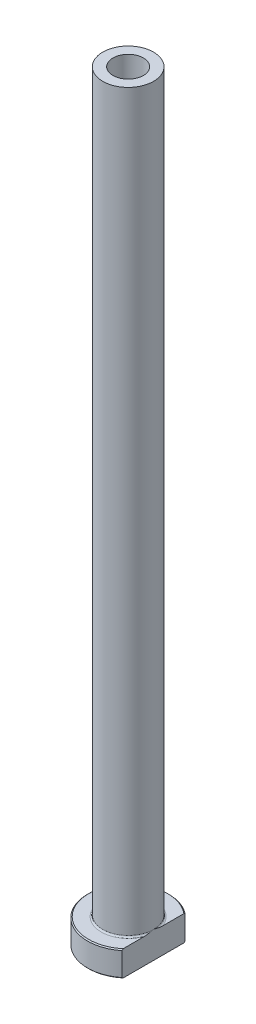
ISO-10303-21;
HEADER;
FILE_DESCRIPTION(('STEP AP214'),'2;1');
FILE_NAME('part.step','',(''),(''),'','','');
FILE_SCHEMA(('AUTOMOTIVE_DESIGN { 1 0 10303 214 1 1 1 1 }'));
ENDSEC;
DATA;
#1=APPLICATION_CONTEXT('core data for automotive mechanical design processes');
#2=APPLICATION_PROTOCOL_DEFINITION('international standard','automotive_design',2000,#1);
#3=PRODUCT_CONTEXT('',#1,'mechanical');
#4=PRODUCT('Part','Part','',(#3));
#5=PRODUCT_RELATED_PRODUCT_CATEGORY('part','',(#4));
#6=PRODUCT_DEFINITION_FORMATION('','',#4);
#7=PRODUCT_DEFINITION_CONTEXT('part definition',#1,'design');
#8=PRODUCT_DEFINITION('design','',#6,#7);
#9=PRODUCT_DEFINITION_SHAPE('','',#8);
#10=(LENGTH_UNIT() NAMED_UNIT(*) SI_UNIT(.MILLI.,.METRE.));
#11=(NAMED_UNIT(*) PLANE_ANGLE_UNIT() SI_UNIT($,.RADIAN.));
#12=(NAMED_UNIT(*) SI_UNIT($,.STERADIAN.) SOLID_ANGLE_UNIT());
#13=UNCERTAINTY_MEASURE_WITH_UNIT(LENGTH_MEASURE(1.E-05),#10,'distance_accuracy_value','');
#14=(GEOMETRIC_REPRESENTATION_CONTEXT(3) GLOBAL_UNCERTAINTY_ASSIGNED_CONTEXT((#13)) GLOBAL_UNIT_ASSIGNED_CONTEXT((#10,
#11,#12)) REPRESENTATION_CONTEXT('',''));
#15=CARTESIAN_POINT('',(0.,0.,0.));
#16=DIRECTION('',(0.,0.,1.));
#17=DIRECTION('',(1.,0.,0.));
#18=AXIS2_PLACEMENT_3D('',#15,#16,#17);
#19=CARTESIAN_POINT('',(0.,92.1876809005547,0.));
#20=DIRECTION('',(0.,1.,0.));
#21=DIRECTION('',(0.,0.,1.));
#22=AXIS2_PLACEMENT_3D('',#19,#20,#21);
#23=CYLINDRICAL_SURFACE('',#22,3.);
#24=CARTESIAN_POINT('',(0.,150.,0.));
#25=DIRECTION('',(0.,1.,0.));
#26=DIRECTION('',(0.,0.,1.));
#27=AXIS2_PLACEMENT_3D('',#24,#25,#26);
#28=CIRCLE('',#27,3.);
#29=CARTESIAN_POINT('',(0.,150.,3.));
#30=VERTEX_POINT('',#29);
#31=EDGE_CURVE('E167',#30,#30,#28,.T.);
#32=ORIENTED_EDGE('',*,*,#31,.T.);
#33=EDGE_LOOP('',(#32));
#34=FACE_BOUND('',#33,.T.);
#35=CARTESIAN_POINT('',(0.,105.,0.));
#36=DIRECTION('',(0.,1.,0.));
#37=DIRECTION('',(0.,0.,1.));
#38=AXIS2_PLACEMENT_3D('',#35,#36,#37);
#39=CIRCLE('',#38,3.);
#40=CARTESIAN_POINT('',(0.,105.,3.));
#41=VERTEX_POINT('',#40);
#42=EDGE_CURVE('E170',#41,#41,#39,.T.);
#43=ORIENTED_EDGE('',*,*,#42,.F.);
#44=EDGE_LOOP('',(#43));
#45=FACE_BOUND('',#44,.T.);
#46=ADVANCED_FACE('F32',(#34,#45),#23,.F.);
#47=CARTESIAN_POINT('',(-3.,150.,0.));
#48=DIRECTION('',(0.,1.,0.));
#49=DIRECTION('',(0.,0.,1.));
#50=AXIS2_PLACEMENT_3D('',#47,#48,#49);
#51=PLANE('',#50);
#52=CARTESIAN_POINT('',(0.,150.,0.));
#53=DIRECTION('',(0.,1.,0.));
#54=DIRECTION('',(0.,0.,1.));
#55=AXIS2_PLACEMENT_3D('',#52,#53,#54);
#56=CIRCLE('',#55,5.00000000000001);
#57=CARTESIAN_POINT('',(0.,150.,5.00000000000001));
#58=VERTEX_POINT('',#57);
#59=EDGE_CURVE('E174',#58,#58,#56,.T.);
#60=ORIENTED_EDGE('',*,*,#59,.T.);
#61=EDGE_LOOP('',(#60));
#62=FACE_BOUND('',#61,.T.);
#63=ORIENTED_EDGE('',*,*,#31,.F.);
#64=EDGE_LOOP('',(#63));
#65=FACE_BOUND('',#64,.T.);
#66=ADVANCED_FACE('F157',(#62,#65),#51,.T.);
#67=CARTESIAN_POINT('',(0.,92.1876809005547,0.));
#68=DIRECTION('',(0.,1.,0.));
#69=DIRECTION('',(0.,0.,1.));
#70=AXIS2_PLACEMENT_3D('',#67,#68,#69);
#71=CYLINDRICAL_SURFACE('',#70,5.);
#72=CARTESIAN_POINT('',(0.,5.3,0.));
#73=DIRECTION('',(0.,1.,0.));
#74=DIRECTION('',(0.,0.,1.));
#75=AXIS2_PLACEMENT_3D('',#72,#73,#74);
#76=CIRCLE('',#75,5.);
#77=CARTESIAN_POINT('',(5.,5.3,0.));
#78=VERTEX_POINT('',#77);
#79=EDGE_CURVE('E180',#78,#78,#76,.T.);
#80=ORIENTED_EDGE('',*,*,#79,.T.);
#81=EDGE_LOOP('',(#80));
#82=FACE_BOUND('',#81,.T.);
#83=ORIENTED_EDGE('',*,*,#59,.F.);
#84=EDGE_LOOP('',(#83));
#85=FACE_BOUND('',#84,.T.);
#86=ADVANCED_FACE('F162',(#82,#85),#71,.T.);
#87=CARTESIAN_POINT('',(-4.99999999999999,5.,0.));
#88=DIRECTION('',(0.,1.,0.));
#89=DIRECTION('',(0.,0.,1.));
#90=AXIS2_PLACEMENT_3D('',#87,#88,#89);
#91=PLANE('',#90);
#92=DIRECTION('',(0.,0.,1.));
#93=VECTOR('',#92,1.);
#94=CARTESIAN_POINT('',(5.,5.,0.));
#95=LINE('',#94,#93);
#96=CARTESIAN_POINT('',(5.,5.,-5.98665181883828));
#97=VERTEX_POINT('',#96);
#98=CARTESIAN_POINT('',(5.,5.,-1.7578395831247));
#99=VERTEX_POINT('',#98);
#100=EDGE_CURVE('E54',#97,#99,#95,.T.);
#101=ORIENTED_EDGE('',*,*,#100,.F.);
#102=CARTESIAN_POINT('',(0.,5.,0.));
#103=DIRECTION('',(0.,1.,0.));
#104=DIRECTION('',(0.,0.,1.));
#105=AXIS2_PLACEMENT_3D('',#102,#103,#104);
#106=CIRCLE('',#105,7.79999999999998);
#107=CARTESIAN_POINT('',(4.99999999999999,5.,5.98665181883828));
#108=VERTEX_POINT('',#107);
#109=EDGE_CURVE('E186',#97,#108,#106,.T.);
#110=ORIENTED_EDGE('',*,*,#109,.T.);
#111=CARTESIAN_POINT('',(5.,5.,1.7578395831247));
#112=VERTEX_POINT('',#111);
#113=EDGE_CURVE('E134',#112,#108,#95,.T.);
#114=ORIENTED_EDGE('',*,*,#113,.F.);
#115=CARTESIAN_POINT('',(0.,5.,0.));
#116=DIRECTION('',(0.,1.,0.));
#117=DIRECTION('',(0.,0.,1.));
#118=AXIS2_PLACEMENT_3D('',#115,#116,#117);
#119=CIRCLE('',#118,5.3);
#120=EDGE_CURVE('E183',#112,#99,#119,.F.);
#121=ORIENTED_EDGE('',*,*,#120,.T.);
#122=EDGE_LOOP('',(#101,#110,#114,#121));
#123=FACE_BOUND('',#122,.T.);
#124=ADVANCED_FACE('F197',(#123),#91,.T.);
#125=CARTESIAN_POINT('',(0.,92.1876809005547,0.));
#126=DIRECTION('',(0.,1.,0.));
#127=DIRECTION('',(0.,0.,1.));
#128=AXIS2_PLACEMENT_3D('',#125,#126,#127);
#129=CYLINDRICAL_SURFACE('',#128,7.99999999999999);
#130=DIRECTION('',(0.,-1.,0.));
#131=VECTOR('',#130,1.);
#132=CARTESIAN_POINT('',(4.99999999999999,150.,6.24499799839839));
#133=LINE('',#132,#131);
#134=CARTESIAN_POINT('',(4.99999999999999,4.79999999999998,6.24499799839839));
#135=VERTEX_POINT('',#134);
#136=CARTESIAN_POINT('',(4.99999999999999,0.200000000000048,6.24499799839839));
#137=VERTEX_POINT('',#136);
#138=EDGE_CURVE('E82',#135,#137,#133,.T.);
#139=ORIENTED_EDGE('',*,*,#138,.F.);
#140=CARTESIAN_POINT('',(0.,4.79999999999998,0.));
#141=DIRECTION('',(0.,1.,0.));
#142=DIRECTION('',(0.,0.,1.));
#143=AXIS2_PLACEMENT_3D('',#140,#141,#142);
#144=CIRCLE('',#143,7.99999999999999);
#145=CARTESIAN_POINT('',(5.,4.79999999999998,-6.24499799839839));
#146=VERTEX_POINT('',#145);
#147=EDGE_CURVE('E95',#135,#146,#144,.F.);
#148=ORIENTED_EDGE('',*,*,#147,.T.);
#149=DIRECTION('',(0.,-1.,0.));
#150=VECTOR('',#149,1.);
#151=CARTESIAN_POINT('',(5.,150.,-6.24499799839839));
#152=LINE('',#151,#150);
#153=CARTESIAN_POINT('',(5.,0.200000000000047,-6.24499799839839));
#154=VERTEX_POINT('',#153);
#155=EDGE_CURVE('E192',#146,#154,#152,.T.);
#156=ORIENTED_EDGE('',*,*,#155,.T.);
#157=CARTESIAN_POINT('',(0.,0.200000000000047,0.));
#158=DIRECTION('',(0.,-1.,0.));
#159=DIRECTION('',(0.,0.,-1.));
#160=AXIS2_PLACEMENT_3D('',#157,#158,#159);
#161=CIRCLE('',#160,7.99999999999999);
#162=EDGE_CURVE('E98',#154,#137,#161,.F.);
#163=ORIENTED_EDGE('',*,*,#162,.T.);
#164=EDGE_LOOP('',(#139,#148,#156,#163));
#165=FACE_BOUND('',#164,.T.);
#166=ADVANCED_FACE('F190',(#165),#129,.T.);
#167=CARTESIAN_POINT('',(-7.99999999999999,0.,0.));
#168=DIRECTION('',(0.,-1.,0.));
#169=DIRECTION('',(0.,0.,-1.));
#170=AXIS2_PLACEMENT_3D('',#167,#168,#169);
#171=PLANE('',#170);
#172=CARTESIAN_POINT('',(0.,0.,0.));
#173=DIRECTION('',(0.,-1.,0.));
#174=DIRECTION('',(0.,0.,-1.));
#175=AXIS2_PLACEMENT_3D('',#172,#173,#174);
#176=CIRCLE('',#175,3.74999999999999);
#177=CARTESIAN_POINT('',(0.,0.,-3.74999999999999));
#178=VERTEX_POINT('',#177);
#179=EDGE_CURVE('E40',#178,#178,#176,.F.);
#180=ORIENTED_EDGE('',*,*,#179,.T.);
#181=EDGE_LOOP('',(#180));
#182=FACE_BOUND('',#181,.T.);
#183=DIRECTION('',(0.,0.,-1.));
#184=VECTOR('',#183,1.);
#185=CARTESIAN_POINT('',(4.99999999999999,0.,6.24499799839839));
#186=LINE('',#185,#184);
#187=CARTESIAN_POINT('',(4.99999999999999,0.,5.98665181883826));
#188=VERTEX_POINT('',#187);
#189=CARTESIAN_POINT('',(5.,0.,-5.98665181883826));
#190=VERTEX_POINT('',#189);
#191=EDGE_CURVE('E47',#188,#190,#186,.T.);
#192=ORIENTED_EDGE('',*,*,#191,.F.);
#193=CARTESIAN_POINT('',(0.,0.,0.));
#194=DIRECTION('',(0.,-1.,0.));
#195=DIRECTION('',(0.,0.,-1.));
#196=AXIS2_PLACEMENT_3D('',#193,#194,#195);
#197=CIRCLE('',#196,7.79999999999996);
#198=EDGE_CURVE('E92',#188,#190,#197,.T.);
#199=ORIENTED_EDGE('',*,*,#198,.T.);
#200=EDGE_LOOP('',(#192,#199));
#201=FACE_BOUND('',#200,.T.);
#202=ADVANCED_FACE('F91',(#182,#201),#171,.T.);
#203=CARTESIAN_POINT('',(0.,92.1876809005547,0.));
#204=DIRECTION('',(0.,1.,0.));
#205=DIRECTION('',(0.,0.,1.));
#206=AXIS2_PLACEMENT_3D('',#203,#204,#205);
#207=CYLINDRICAL_SURFACE('',#206,3.25);
#208=CARTESIAN_POINT('',(0.,0.5,0.));
#209=DIRECTION('',(0.,-1.,0.));
#210=DIRECTION('',(0.,0.,-1.));
#211=AXIS2_PLACEMENT_3D('',#208,#209,#210);
#212=CIRCLE('',#211,3.25);
#213=CARTESIAN_POINT('',(0.,0.5,-3.25));
#214=VERTEX_POINT('',#213);
#215=EDGE_CURVE('E11',#214,#214,#212,.T.);
#216=ORIENTED_EDGE('',*,*,#215,.T.);
#217=EDGE_LOOP('',(#216));
#218=FACE_BOUND('',#217,.T.);
#219=CARTESIAN_POINT('',(0.,93.,0.));
#220=DIRECTION('',(0.,1.,0.));
#221=DIRECTION('',(0.,0.,1.));
#222=AXIS2_PLACEMENT_3D('',#219,#220,#221);
#223=CIRCLE('',#222,3.25);
#224=CARTESIAN_POINT('',(0.,93.,3.25));
#225=VERTEX_POINT('',#224);
#226=EDGE_CURVE('E172',#225,#225,#223,.T.);
#227=ORIENTED_EDGE('',*,*,#226,.T.);
#228=EDGE_LOOP('',(#227));
#229=FACE_BOUND('',#228,.T.);
#230=ADVANCED_FACE('F215',(#218,#229),#207,.F.);
#231=CARTESIAN_POINT('',(0.,93.,0.));
#232=DIRECTION('',(0.,-1.,0.));
#233=DIRECTION('',(0.,0.,-1.));
#234=AXIS2_PLACEMENT_3D('',#231,#232,#233);
#235=CONICAL_SURFACE('',#234,3.25,0.0208303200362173);
#236=ORIENTED_EDGE('',*,*,#42,.T.);
#237=EDGE_LOOP('',(#236));
#238=FACE_BOUND('',#237,.T.);
#239=ORIENTED_EDGE('',*,*,#226,.F.);
#240=EDGE_LOOP('',(#239));
#241=FACE_BOUND('',#240,.T.);
#242=ADVANCED_FACE('F111',(#238,#241),#235,.F.);
#243=CARTESIAN_POINT('',(0.,5.3,0.));
#244=DIRECTION('',(0.,1.,0.));
#245=DIRECTION('',(0.,0.,1.));
#246=AXIS2_PLACEMENT_3D('',#243,#244,#245);
#247=TOROIDAL_SURFACE('',#246,5.3,0.3);
#248=ORIENTED_EDGE('',*,*,#120,.F.);
#249=CARTESIAN_POINT('',(5.,5.3,0.));
#250=CARTESIAN_POINT('',(5.,5.30000062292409,-1.31469405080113E-10));
#251=CARTESIAN_POINT('',(5.,5.30000124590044,2.52759284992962E-07));
#252=CARTESIAN_POINT('',(5.,5.30000240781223,9.47164481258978E-07));
#253=CARTESIAN_POINT('',(5.,5.30000293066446,1.40594053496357E-06));
#254=CARTESIAN_POINT('',(5.,5.30000402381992,2.50637628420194E-06));
#255=CARTESIAN_POINT('',(5.,5.30000457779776,3.16588935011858E-06));
#256=CARTESIAN_POINT('',(5.,5.30000556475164,4.5285999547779E-06));
#257=CARTESIAN_POINT('',(5.,5.30000600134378,5.22939475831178E-06));
#258=CARTESIAN_POINT('',(5.,5.30000763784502,7.96122031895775E-06));
#259=CARTESIAN_POINT('',(5.,5.30000875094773,1.00477415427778E-05));
#260=CARTESIAN_POINT('',(5.,5.30001056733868,1.41660880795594E-05));
#261=CARTESIAN_POINT('',(5.,5.30001129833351,1.6186178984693E-05));
#262=CARTESIAN_POINT('',(5.,5.3000143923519,2.47865751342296E-05));
#263=CARTESIAN_POINT('',(5.,5.30001672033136,3.13830297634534E-05));
#264=CARTESIAN_POINT('',(5.,5.30002012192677,4.38084236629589E-05));
#265=CARTESIAN_POINT('',(5.,5.30002133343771,4.95992753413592E-05));
#266=CARTESIAN_POINT('',(5.,5.30003020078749,9.27862636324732E-05));
#267=CARTESIAN_POINT('',(5.,5.30003696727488,0.000130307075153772));
#268=CARTESIAN_POINT('',(4.99999999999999,5.30006659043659,0.000278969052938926));
#269=CARTESIAN_POINT('',(4.99999999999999,5.30009481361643,0.000389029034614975));
#270=CARTESIAN_POINT('',(5.,5.30020506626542,0.000826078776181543));
#271=CARTESIAN_POINT('',(5.,5.30028365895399,0.00115365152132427));
#272=CARTESIAN_POINT('',(4.99999999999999,5.30059919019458,0.0024592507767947));
#273=CARTESIAN_POINT('',(4.99999999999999,5.30084048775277,0.00343651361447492));
#274=CARTESIAN_POINT('',(5.,5.30184626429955,0.00752058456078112));
#275=CARTESIAN_POINT('',(5.,5.30260525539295,0.0106283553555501));
#276=CARTESIAN_POINT('',(4.99999999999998,5.30996461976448,0.0407482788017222));
#277=CARTESIAN_POINT('',(4.99999999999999,5.31658985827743,0.0677561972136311));
#278=CARTESIAN_POINT('',(5.,5.32953319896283,0.120688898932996));
#279=CARTESIAN_POINT('',(5.,5.33585289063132,0.146613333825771));
#280=CARTESIAN_POINT('',(4.99999999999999,5.34926050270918,0.201795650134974));
#281=CARTESIAN_POINT('',(5.,5.35634306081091,0.231054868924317));
#282=CARTESIAN_POINT('',(5.,5.37050252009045,0.289917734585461));
#283=CARTESIAN_POINT('',(5.,5.37757848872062,0.319521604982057));
#284=CARTESIAN_POINT('',(5.,5.39452602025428,0.391032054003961));
#285=CARTESIAN_POINT('',(5.,5.40434071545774,0.432952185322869));
#286=CARTESIAN_POINT('',(5.,5.42340141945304,0.515763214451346));
#287=CARTESIAN_POINT('',(5.,5.43265559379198,0.556652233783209));
#288=CARTESIAN_POINT('',(5.,5.45710553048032,0.667075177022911));
#289=CARTESIAN_POINT('',(5.,5.47194176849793,0.736689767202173));
#290=CARTESIAN_POINT('',(5.,5.50018229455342,0.876836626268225));
#291=CARTESIAN_POINT('',(5.,5.51357312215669,0.947371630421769));
#292=CARTESIAN_POINT('',(5.,5.53930921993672,1.09497328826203));
#293=CARTESIAN_POINT('',(5.,5.55146217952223,1.17207432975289));
#294=CARTESIAN_POINT('',(5.,5.57239669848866,1.32672649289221));
#295=CARTESIAN_POINT('',(5.,5.58117877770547,1.40427754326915));
#296=CARTESIAN_POINT('',(5.,5.59499725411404,1.56873827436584));
#297=CARTESIAN_POINT('',(5.,5.59948802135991,1.65570044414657));
#298=CARTESIAN_POINT('',(5.,5.60018885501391,1.785353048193));
#299=CARTESIAN_POINT('',(5.,5.5994521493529,1.82802575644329));
#300=CARTESIAN_POINT('',(5.,5.59559364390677,1.91325081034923));
#301=CARTESIAN_POINT('',(5.,5.59247319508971,1.95580321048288));
#302=CARTESIAN_POINT('',(5.,5.5838324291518,2.03512365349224));
#303=CARTESIAN_POINT('',(5.,5.57867386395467,2.07192937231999));
#304=CARTESIAN_POINT('',(5.,5.56543793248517,2.14526756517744));
#305=CARTESIAN_POINT('',(5.,5.55734203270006,2.18179676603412));
#306=CARTESIAN_POINT('',(5.,5.53718005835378,2.25427226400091));
#307=CARTESIAN_POINT('',(5.,5.52507057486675,2.29020746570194));
#308=CARTESIAN_POINT('',(5.,5.50270928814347,2.34223029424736));
#309=CARTESIAN_POINT('',(5.,5.49457811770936,2.35922314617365));
#310=CARTESIAN_POINT('',(5.,5.47657809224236,2.39224900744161));
#311=CARTESIAN_POINT('',(5.,5.46671281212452,2.40828390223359));
#312=CARTESIAN_POINT('',(5.,5.44695893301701,2.43579467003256));
#313=CARTESIAN_POINT('',(5.,5.43745879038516,2.44754592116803));
#314=CARTESIAN_POINT('',(5.,5.4167791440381,2.46946476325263));
#315=CARTESIAN_POINT('',(5.,5.4056054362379,2.47963758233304));
#316=CARTESIAN_POINT('',(5.,5.38617750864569,2.49393642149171));
#317=CARTESIAN_POINT('',(5.,5.3785164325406,2.49886271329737));
#318=CARTESIAN_POINT('',(5.,5.362527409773,2.50749953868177));
#319=CARTESIAN_POINT('',(5.,5.35419984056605,2.51121075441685));
#320=CARTESIAN_POINT('',(5.,5.33690648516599,2.51712941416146));
#321=CARTESIAN_POINT('',(5.,5.32793451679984,2.5193192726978));
#322=CARTESIAN_POINT('',(5.,5.30973576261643,2.52185978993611));
#323=CARTESIAN_POINT('',(5.,5.30050931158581,2.52221275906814));
#324=CARTESIAN_POINT('',(5.,5.28349166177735,2.52112455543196));
#325=CARTESIAN_POINT('',(5.,5.27568322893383,2.51993178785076));
#326=CARTESIAN_POINT('',(5.,5.26036860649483,2.51628294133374));
#327=CARTESIAN_POINT('',(5.,5.25286261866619,2.51382603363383));
#328=CARTESIAN_POINT('',(5.,5.2359026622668,2.50685484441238));
#329=CARTESIAN_POINT('',(5.,5.22661875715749,2.50192984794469));
#330=CARTESIAN_POINT('',(5.,5.20895514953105,2.49066548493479));
#331=CARTESIAN_POINT('',(5.,5.20057756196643,2.48432291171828));
#332=CARTESIAN_POINT('',(5.,5.1798700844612,2.46645212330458));
#333=CARTESIAN_POINT('',(5.,5.16824151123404,2.45411867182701));
#334=CARTESIAN_POINT('',(5.,5.14692461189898,2.42790849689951));
#335=CARTESIAN_POINT('',(5.,5.13723987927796,2.41402898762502));
#336=CARTESIAN_POINT('',(5.,5.11080706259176,2.37143175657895));
#337=CARTESIAN_POINT('',(5.,5.09628770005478,2.34134703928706));
#338=CARTESIAN_POINT('',(5.,5.07130349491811,2.27940731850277));
#339=CARTESIAN_POINT('',(5.,5.06087110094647,2.24754035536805));
#340=CARTESIAN_POINT('',(5.,5.03890359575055,2.16787245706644));
#341=CARTESIAN_POINT('',(5.,5.02913523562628,2.1195906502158));
#342=CARTESIAN_POINT('',(5.,5.01416953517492,2.02224928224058));
#343=CARTESIAN_POINT('',(5.,5.00898637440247,1.97318778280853));
#344=CARTESIAN_POINT('',(5.,5.00220823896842,1.87635767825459));
#345=CARTESIAN_POINT('',(5.,5.00050709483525,1.82859609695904));
#346=CARTESIAN_POINT('',(5.,4.999691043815,1.73330165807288));
#347=CARTESIAN_POINT('',(5.,5.00056327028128,1.68576884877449));
#348=CARTESIAN_POINT('',(5.,5.00484296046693,1.57937770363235));
#349=CARTESIAN_POINT('',(5.,5.00880932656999,1.52054285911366));
#350=CARTESIAN_POINT('',(5.,5.01925964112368,1.40312974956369));
#351=CARTESIAN_POINT('',(5.,5.02574264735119,1.34455139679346));
#352=CARTESIAN_POINT('',(5.,5.04090087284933,1.22627662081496));
#353=CARTESIAN_POINT('',(5.,5.04962425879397,1.16658647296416));
#354=CARTESIAN_POINT('',(5.,5.06877923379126,1.04732463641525));
#355=CARTESIAN_POINT('',(5.,5.07921523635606,0.987753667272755));
#356=CARTESIAN_POINT('',(5.,5.10551698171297,0.846936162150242));
#357=CARTESIAN_POINT('',(5.,5.12196565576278,0.765799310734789));
#358=CARTESIAN_POINT('',(5.,5.15639716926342,0.604819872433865));
#359=CARTESIAN_POINT('',(5.,5.17436050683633,0.524973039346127));
#360=CARTESIAN_POINT('',(4.99999999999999,5.2092166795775,0.374726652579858));
#361=CARTESIAN_POINT('',(4.99999999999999,5.22599388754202,0.304300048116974));
#362=CARTESIAN_POINT('',(5.,5.25191105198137,0.196907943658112));
#363=CARTESIAN_POINT('',(5.,5.26090146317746,0.159905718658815));
#364=CARTESIAN_POINT('',(4.99999999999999,5.27881854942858,0.0865164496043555));
#365=CARTESIAN_POINT('',(4.99999999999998,5.28774391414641,0.0501291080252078));
#366=CARTESIAN_POINT('',(5.,5.2973962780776,0.0106218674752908));
#367=CARTESIAN_POINT('',(5.,5.29815688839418,0.00750762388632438));
#368=CARTESIAN_POINT('',(4.99999999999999,5.29916304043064,0.00342209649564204));
#369=CARTESIAN_POINT('',(4.99999999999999,5.29940309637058,0.00244985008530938));
#370=CARTESIAN_POINT('',(5.,5.29971711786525,0.00115049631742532));
#371=CARTESIAN_POINT('',(5.,5.29979541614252,0.000824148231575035));
#372=CARTESIAN_POINT('',(4.99999999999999,5.29990531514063,0.000388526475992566));
#373=CARTESIAN_POINT('',(4.99999999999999,5.299933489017,0.000278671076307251));
#374=CARTESIAN_POINT('',(5.,5.29996306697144,0.000130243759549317));
#375=CARTESIAN_POINT('',(5.,5.29996982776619,9.27511401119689E-05));
#376=CARTESIAN_POINT('',(5.,5.29997868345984,4.95929903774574E-05));
#377=CARTESIAN_POINT('',(5.,5.29997989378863,4.38036571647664E-05));
#378=CARTESIAN_POINT('',(5.,5.29998329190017,3.13814199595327E-05));
#379=CARTESIAN_POINT('',(5.,5.29998561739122,2.47865230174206E-05));
#380=CARTESIAN_POINT('',(5.,5.29998870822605,1.61877553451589E-05));
#381=CARTESIAN_POINT('',(5.,5.29998943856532,1.41677775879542E-05));
#382=CARTESIAN_POINT('',(5.,5.29999125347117,1.00495537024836E-05));
#383=CARTESIAN_POINT('',(5.,5.29999236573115,7.96302707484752E-06));
#384=CARTESIAN_POINT('',(5.,5.29999400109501,5.23107447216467E-06));
#385=CARTESIAN_POINT('',(5.,5.29999443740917,4.53021065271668E-06));
#386=CARTESIAN_POINT('',(5.,5.29999542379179,3.16731183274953E-06));
#387=CARTESIAN_POINT('',(5.,5.29999597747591,2.50767750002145E-06));
#388=CARTESIAN_POINT('',(5.,5.29999707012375,1.40695895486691E-06));
#389=CARTESIAN_POINT('',(5.,5.29999759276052,9.48032589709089E-07));
#390=CARTESIAN_POINT('',(5.,5.29999875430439,2.53244394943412E-07));
#391=CARTESIAN_POINT('',(5.,5.29999937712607,1.31460206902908E-10));
#392=CARTESIAN_POINT('',(5.,5.3,0.));
#393=B_SPLINE_CURVE_WITH_KNOTS('',3,(#249,#250,#251,#252,#253,#254,#255,#256,#257,#258,#259,
#260,#261,#262,#263,#264,#265,#266,#267,#268,#269,#270,#271,#272,#273,#274,#275,#276,#277,#278,
#279,#280,#281,#282,#283,#284,#285,#286,#287,#288,#289,#290,#291,#292,#293,#294,#295,#296,#297,
#298,#299,#300,#301,#302,#303,#304,#305,#306,#307,#308,#309,#310,#311,#312,#313,#314,#315,#316,
#317,#318,#319,#320,#321,#322,#323,#324,#325,#326,#327,#328,#329,#330,#331,#332,#333,#334,#335,
#336,#337,#338,#339,#340,#341,#342,#343,#344,#345,#346,#347,#348,#349,#350,#351,#352,#353,#354,
#355,#356,#357,#358,#359,#360,#361,#362,#363,#364,#365,#366,#367,#368,#369,#370,#371,#372,#373,
#374,#375,#376,#377,#378,#379,#380,#381,#382,#383,#384,#385,#386,#387,#388,#389,#390,#391,#392),
.UNSPECIFIED.,.T.,.F.,(4,2,2,2,2,2,2,2,2,2,2,2,2,2,2,2,2,2,2,2,2,2,2,2,2,2,2,2,2,2,2,2,2,2,2,2,
2,2,2,2,2,2,2,2,2,2,2,2,2,2,2,2,2,2,2,2,2,2,2,2,2,2,2,2,2,2,2,2,2,2,2,4),(0.,
1.88939227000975E-06,3.98058756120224E-06,6.54818360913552E-06,9.02404134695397E-06,
1.60938721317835E-05,2.25328161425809E-05,4.34843886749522E-05,6.12120154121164E-05,
0.00017562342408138,0.000516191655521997,0.00152710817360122,0.0045465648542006,
0.0141443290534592,0.0975679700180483,0.177619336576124,0.267931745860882,0.359245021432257,
0.488405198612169,0.614173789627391,0.827694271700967,1.04305715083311,1.27715608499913,
1.51121890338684,1.77214751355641,1.90013509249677,2.02805018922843,2.13945459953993,
2.25157451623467,2.36494894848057,2.42139235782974,2.4777207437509,2.52293802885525,
2.56800219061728,2.59524342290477,2.62246933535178,2.65000494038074,2.67750590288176,
2.70108948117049,2.72468854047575,2.75603978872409,2.78746268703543,2.83802806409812,
2.88868607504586,2.98834295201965,3.08877575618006,3.23618650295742,3.38405153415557,
3.52733651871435,3.66990630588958,3.84673903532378,4.02350562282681,4.20444776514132,
4.38586374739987,4.63419556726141,4.87971270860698,5.09690175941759,5.21113882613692,
5.32353360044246,5.33315137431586,5.33615533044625,5.33716246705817,5.33750240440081,
5.33761672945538,5.33763445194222,5.33765539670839,5.3376618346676,5.33766890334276,
5.33767137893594,5.33767394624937,5.33767603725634,5.33767792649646),.UNSPECIFIED.);
#394=EDGE_CURVE('E126',#112,#78,#393,.T.);
#395=ORIENTED_EDGE('',*,*,#394,.T.);
#396=ORIENTED_EDGE('',*,*,#79,.F.);
#397=CARTESIAN_POINT('',(5.,5.3,0.));
#398=CARTESIAN_POINT('',(5.,5.29999937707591,1.3147082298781E-10));
#399=CARTESIAN_POINT('',(5.,5.29999875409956,-2.5275928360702E-07));
#400=CARTESIAN_POINT('',(5.,5.29999759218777,-9.47164479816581E-07));
#401=CARTESIAN_POINT('',(5.,5.29999706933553,-1.40594053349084E-06));
#402=CARTESIAN_POINT('',(5.,5.29999597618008,-2.50637628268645E-06));
#403=CARTESIAN_POINT('',(5.,5.29999542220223,-3.16588934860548E-06));
#404=CARTESIAN_POINT('',(5.,5.29999443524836,-4.52859995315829E-06));
#405=CARTESIAN_POINT('',(5.,5.29999399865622,-5.22939475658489E-06));
#406=CARTESIAN_POINT('',(5.,5.29999236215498,-7.96122031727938E-06));
#407=CARTESIAN_POINT('',(5.,5.29999124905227,-1.00477415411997E-05));
#408=CARTESIAN_POINT('',(5.,5.29998943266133,-1.41660880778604E-05));
#409=CARTESIAN_POINT('',(5.,5.2999887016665,-1.61861789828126E-05));
#410=CARTESIAN_POINT('',(5.,5.2999856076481,-2.47865751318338E-05));
#411=CARTESIAN_POINT('',(5.,5.29998327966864,-3.13830297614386E-05));
#412=CARTESIAN_POINT('',(5.,5.29997987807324,-4.38084236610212E-05));
#413=CARTESIAN_POINT('',(5.,5.2999786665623,-4.95992753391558E-05));
#414=CARTESIAN_POINT('',(5.,5.29996979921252,-9.27862636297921E-05));
#415=CARTESIAN_POINT('',(5.,5.29996303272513,-0.000130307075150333));
#416=CARTESIAN_POINT('',(4.99999999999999,5.29993340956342,-0.000278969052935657));
#417=CARTESIAN_POINT('',(4.99999999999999,5.29990518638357,-0.000389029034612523));
#418=CARTESIAN_POINT('',(5.,5.29979493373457,-0.000826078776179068));
#419=CARTESIAN_POINT('',(5.,5.29971634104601,-0.00115365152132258));
#420=CARTESIAN_POINT('',(4.99999999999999,5.29940080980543,-0.00245925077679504));
#421=CARTESIAN_POINT('',(4.99999999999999,5.29915951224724,-0.0034365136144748));
#422=CARTESIAN_POINT('',(5.,5.29815373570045,-0.00752058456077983));
#423=CARTESIAN_POINT('',(5.,5.29739474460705,-0.0106283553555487));
#424=CARTESIAN_POINT('',(4.99999999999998,5.2900353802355,-0.0407482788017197));
#425=CARTESIAN_POINT('',(4.99999999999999,5.28341014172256,-0.0677561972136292));
#426=CARTESIAN_POINT('',(5.,5.27046680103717,-0.120688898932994));
#427=CARTESIAN_POINT('',(5.,5.26414710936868,-0.146613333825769));
#428=CARTESIAN_POINT('',(4.99999999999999,5.25073949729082,-0.201795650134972));
#429=CARTESIAN_POINT('',(5.,5.24365693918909,-0.231054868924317));
#430=CARTESIAN_POINT('',(5.,5.22949747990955,-0.289917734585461));
#431=CARTESIAN_POINT('',(5.,5.22242151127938,-0.319521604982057));
#432=CARTESIAN_POINT('',(5.,5.20547397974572,-0.391032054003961));
#433=CARTESIAN_POINT('',(5.,5.19565928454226,-0.432952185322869));
#434=CARTESIAN_POINT('',(5.,5.17659858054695,-0.515763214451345));
#435=CARTESIAN_POINT('',(5.,5.16734440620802,-0.556652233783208));
#436=CARTESIAN_POINT('',(5.,5.14289446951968,-0.667075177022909));
#437=CARTESIAN_POINT('',(5.,5.12805823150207,-0.736689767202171));
#438=CARTESIAN_POINT('',(5.,5.09981770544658,-0.876836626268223));
#439=CARTESIAN_POINT('',(5.,5.0864268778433,-0.947371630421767));
#440=CARTESIAN_POINT('',(5.,5.06069078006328,-1.09497328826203));
#441=CARTESIAN_POINT('',(5.,5.04853782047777,-1.17207432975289));
#442=CARTESIAN_POINT('',(5.,5.02760330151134,-1.3267264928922));
#443=CARTESIAN_POINT('',(5.,5.01882122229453,-1.40427754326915));
#444=CARTESIAN_POINT('',(5.,5.00500274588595,-1.56873827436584));
#445=CARTESIAN_POINT('',(5.,5.00051197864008,-1.65570044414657));
#446=CARTESIAN_POINT('',(5.,4.99981114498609,-1.785353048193));
#447=CARTESIAN_POINT('',(5.,5.0005478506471,-1.82802575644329));
#448=CARTESIAN_POINT('',(5.,5.00440635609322,-1.91325081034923));
#449=CARTESIAN_POINT('',(5.,5.00752680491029,-1.95580321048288));
#450=CARTESIAN_POINT('',(5.,5.0161675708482,-2.03512365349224));
#451=CARTESIAN_POINT('',(5.,5.02132613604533,-2.07192937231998));
#452=CARTESIAN_POINT('',(5.,5.03456206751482,-2.14526756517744));
#453=CARTESIAN_POINT('',(5.,5.04265796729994,-2.18179676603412));
#454=CARTESIAN_POINT('',(5.,5.06281994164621,-2.2542722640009));
#455=CARTESIAN_POINT('',(5.,5.07492942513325,-2.29020746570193));
#456=CARTESIAN_POINT('',(5.,5.09729071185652,-2.34223029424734));
#457=CARTESIAN_POINT('',(5.,5.10542188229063,-2.35922314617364));
#458=CARTESIAN_POINT('',(5.,5.12342190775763,-2.39224900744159));
#459=CARTESIAN_POINT('',(5.,5.13328718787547,-2.40828390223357));
#460=CARTESIAN_POINT('',(5.,5.15304106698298,-2.43579467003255));
#461=CARTESIAN_POINT('',(5.,5.16254120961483,-2.44754592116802));
#462=CARTESIAN_POINT('',(5.,5.18322085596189,-2.46946476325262));
#463=CARTESIAN_POINT('',(5.,5.19439456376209,-2.47963758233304));
#464=CARTESIAN_POINT('',(5.,5.2138224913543,-2.49393642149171));
#465=CARTESIAN_POINT('',(5.,5.22148356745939,-2.49886271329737));
#466=CARTESIAN_POINT('',(5.,5.237472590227,-2.50749953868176));
#467=CARTESIAN_POINT('',(5.,5.24580015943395,-2.51121075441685));
#468=CARTESIAN_POINT('',(5.,5.26309351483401,-2.51712941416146));
#469=CARTESIAN_POINT('',(5.,5.27206548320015,-2.5193192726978));
#470=CARTESIAN_POINT('',(5.,5.29026423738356,-2.52185978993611));
#471=CARTESIAN_POINT('',(5.,5.29949068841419,-2.52221275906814));
#472=CARTESIAN_POINT('',(5.,5.31650833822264,-2.52112455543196));
#473=CARTESIAN_POINT('',(5.,5.32431677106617,-2.51993178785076));
#474=CARTESIAN_POINT('',(5.,5.33963139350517,-2.51628294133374));
#475=CARTESIAN_POINT('',(5.,5.34713738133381,-2.51382603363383));
#476=CARTESIAN_POINT('',(5.,5.3640973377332,-2.50685484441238));
#477=CARTESIAN_POINT('',(5.,5.3733812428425,-2.50192984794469));
#478=CARTESIAN_POINT('',(5.,5.39104485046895,-2.4906654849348));
#479=CARTESIAN_POINT('',(5.,5.39942243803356,-2.48432291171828));
#480=CARTESIAN_POINT('',(5.,5.42012991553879,-2.46645212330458));
#481=CARTESIAN_POINT('',(5.,5.43175848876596,-2.45411867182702));
#482=CARTESIAN_POINT('',(5.,5.45307538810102,-2.42790849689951));
#483=CARTESIAN_POINT('',(5.,5.46276012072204,-2.41402898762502));
#484=CARTESIAN_POINT('',(5.,5.48919293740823,-2.37143175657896));
#485=CARTESIAN_POINT('',(5.,5.50371229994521,-2.34134703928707));
#486=CARTESIAN_POINT('',(5.,5.52869650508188,-2.27940731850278));
#487=CARTESIAN_POINT('',(5.,5.53912889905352,-2.24754035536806));
#488=CARTESIAN_POINT('',(5.,5.56109640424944,-2.16787245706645));
#489=CARTESIAN_POINT('',(5.,5.57086476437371,-2.11959065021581));
#490=CARTESIAN_POINT('',(5.,5.58583046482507,-2.0222492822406));
#491=CARTESIAN_POINT('',(5.,5.59101362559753,-1.97318778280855));
#492=CARTESIAN_POINT('',(5.,5.59779176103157,-1.87635767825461));
#493=CARTESIAN_POINT('',(5.,5.59949290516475,-1.82859609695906));
#494=CARTESIAN_POINT('',(5.,5.600308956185,-1.73330165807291));
#495=CARTESIAN_POINT('',(5.,5.59943672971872,-1.68576884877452));
#496=CARTESIAN_POINT('',(5.,5.59515703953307,-1.57937770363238));
#497=CARTESIAN_POINT('',(5.,5.59119067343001,-1.52054285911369));
#498=CARTESIAN_POINT('',(5.,5.58074035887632,-1.40312974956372));
#499=CARTESIAN_POINT('',(5.,5.57425735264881,-1.34455139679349));
#500=CARTESIAN_POINT('',(5.,5.55909912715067,-1.22627662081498));
#501=CARTESIAN_POINT('',(5.,5.55037574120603,-1.16658647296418));
#502=CARTESIAN_POINT('',(5.,5.53122076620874,-1.04732463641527));
#503=CARTESIAN_POINT('',(5.,5.52078476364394,-0.987753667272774));
#504=CARTESIAN_POINT('',(5.,5.49448301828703,-0.846936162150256));
#505=CARTESIAN_POINT('',(5.,5.47803434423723,-0.765799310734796));
#506=CARTESIAN_POINT('',(5.,5.44360283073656,-0.604819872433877));
#507=CARTESIAN_POINT('',(5.,5.4256394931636,-0.524973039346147));
#508=CARTESIAN_POINT('',(4.99999999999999,5.39078332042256,-0.374726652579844));
#509=CARTESIAN_POINT('',(4.99999999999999,5.37400611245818,-0.304300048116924));
#510=CARTESIAN_POINT('',(5.,5.34808894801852,-0.196907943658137));
#511=CARTESIAN_POINT('',(5.,5.33909853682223,-0.159905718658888));
#512=CARTESIAN_POINT('',(4.99999999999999,5.32118145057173,-0.0865164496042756));
#513=CARTESIAN_POINT('',(4.99999999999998,5.3122560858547,-0.0501291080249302));
#514=CARTESIAN_POINT('',(5.,5.3026037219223,-0.0106218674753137));
#515=CARTESIAN_POINT('',(5.,5.30184311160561,-0.00750762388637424));
#516=CARTESIAN_POINT('',(4.99999999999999,5.30083695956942,-0.0034220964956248));
#517=CARTESIAN_POINT('',(4.99999999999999,5.30059690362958,-0.00244985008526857));
#518=CARTESIAN_POINT('',(5.,5.3002828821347,-0.00115049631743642));
#519=CARTESIAN_POINT('',(5.,5.30020458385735,-0.000824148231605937));
#520=CARTESIAN_POINT('',(4.99999999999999,5.30009468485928,-0.000388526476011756));
#521=CARTESIAN_POINT('',(4.99999999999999,5.30006651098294,-0.000278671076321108));
#522=CARTESIAN_POINT('',(5.,5.30003693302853,-0.000130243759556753));
#523=CARTESIAN_POINT('',(5.,5.30003017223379,-9.27511401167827E-05));
#524=CARTESIAN_POINT('',(5.,5.30002131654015,-4.95929903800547E-05));
#525=CARTESIAN_POINT('',(5.,5.30002010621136,-4.38036571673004E-05));
#526=CARTESIAN_POINT('',(5.,5.30001670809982,-3.13814199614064E-05));
#527=CARTESIAN_POINT('',(5.,5.30001438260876,-2.47865230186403E-05));
#528=CARTESIAN_POINT('',(5.,5.30001129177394,-1.61877553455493E-05));
#529=CARTESIAN_POINT('',(5.,5.30001056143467,-1.41677775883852E-05));
#530=CARTESIAN_POINT('',(5.,5.30000874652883,-1.00495537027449E-05));
#531=CARTESIAN_POINT('',(5.,5.30000763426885,-7.96302707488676E-06));
#532=CARTESIAN_POINT('',(5.,5.30000599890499,-5.23107447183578E-06));
#533=CARTESIAN_POINT('',(5.,5.30000556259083,-4.53021065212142E-06));
#534=CARTESIAN_POINT('',(5.,5.30000457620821,-3.1673118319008E-06));
#535=CARTESIAN_POINT('',(5.,5.30000402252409,-2.50767749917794E-06));
#536=CARTESIAN_POINT('',(5.,5.30000292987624,-1.4069589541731E-06));
#537=CARTESIAN_POINT('',(5.,5.30000240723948,-9.4803258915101E-07));
#538=CARTESIAN_POINT('',(5.,5.30000124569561,-2.53244393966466E-07));
#539=CARTESIAN_POINT('',(5.,5.30000062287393,-1.31458847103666E-10));
#540=CARTESIAN_POINT('',(5.,5.3,0.));
#541=B_SPLINE_CURVE_WITH_KNOTS('',3,(#397,#398,#399,#400,#401,#402,#403,#404,#405,#406,#407,
#408,#409,#410,#411,#412,#413,#414,#415,#416,#417,#418,#419,#420,#421,#422,#423,#424,#425,#426,
#427,#428,#429,#430,#431,#432,#433,#434,#435,#436,#437,#438,#439,#440,#441,#442,#443,#444,#445,
#446,#447,#448,#449,#450,#451,#452,#453,#454,#455,#456,#457,#458,#459,#460,#461,#462,#463,#464,
#465,#466,#467,#468,#469,#470,#471,#472,#473,#474,#475,#476,#477,#478,#479,#480,#481,#482,#483,
#484,#485,#486,#487,#488,#489,#490,#491,#492,#493,#494,#495,#496,#497,#498,#499,#500,#501,#502,
#503,#504,#505,#506,#507,#508,#509,#510,#511,#512,#513,#514,#515,#516,#517,#518,#519,#520,#521,
#522,#523,#524,#525,#526,#527,#528,#529,#530,#531,#532,#533,#534,#535,#536,#537,#538,#539,#540),
.UNSPECIFIED.,.T.,.F.,(4,2,2,2,2,2,2,2,2,2,2,2,2,2,2,2,2,2,2,2,2,2,2,2,2,2,2,2,2,2,2,2,2,2,2,2,
2,2,2,2,2,2,2,2,2,2,2,2,2,2,2,2,2,2,2,2,2,2,2,2,2,2,2,2,2,2,2,2,2,2,2,4),(0.,
1.88939226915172E-06,3.98058756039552E-06,6.54818360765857E-06,9.02404134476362E-06,
1.60938721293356E-05,2.25328161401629E-05,4.34843886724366E-05,6.12120154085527E-05,
0.000175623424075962,0.000516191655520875,0.00152710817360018,0.00454656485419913,
0.0141443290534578,0.0975679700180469,0.177619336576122,0.267931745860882,0.359245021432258,
0.488405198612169,0.614173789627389,0.827694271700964,1.04305715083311,1.27715608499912,
1.51121890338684,1.77214751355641,1.90013509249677,2.02805018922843,2.13945459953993,
2.25157451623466,2.36494894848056,2.42139235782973,2.47772074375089,2.52293802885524,
2.56800219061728,2.59524342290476,2.62246933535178,2.65000494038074,2.67750590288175,
2.70108948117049,2.72468854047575,2.75603978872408,2.78746268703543,2.83802806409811,
2.88868607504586,2.98834295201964,3.08877575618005,3.2361865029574,3.38405153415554,
3.52733651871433,3.66990630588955,3.84673903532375,4.02350562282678,4.2044477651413,
4.38586374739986,4.6341955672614,4.87971270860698,5.09690175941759,5.21113882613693,
5.32353360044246,5.33315137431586,5.33615533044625,5.33716246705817,5.33750240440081,
5.33761672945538,5.33763445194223,5.33765539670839,5.3376618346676,5.33766890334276,
5.33767137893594,5.33767394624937,5.33767603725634,5.33767792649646),.UNSPECIFIED.);
#542=EDGE_CURVE('E135',#78,#99,#541,.T.);
#543=ORIENTED_EDGE('',*,*,#542,.T.);
#544=EDGE_LOOP('',(#248,#395,#396,#543));
#545=FACE_BOUND('',#544,.T.);
#546=ADVANCED_FACE('F141',(#545),#247,.F.);
#547=CARTESIAN_POINT('',(0.,5.,0.));
#548=DIRECTION('',(0.,-1.,0.));
#549=DIRECTION('',(0.,0.,-1.));
#550=AXIS2_PLACEMENT_3D('',#547,#548,#549);
#551=CONICAL_SURFACE('',#550,7.79999999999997,0.78539816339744);
#552=CARTESIAN_POINT('',(5.,-1.82162423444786,-13.7401563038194));
#553=CARTESIAN_POINT('',(5.,-1.61889813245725,-13.5244204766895));
#554=CARTESIAN_POINT('',(5.,-1.4164638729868,-13.3084101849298));
#555=CARTESIAN_POINT('',(5.,-1.01227657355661,-12.8757508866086));
#556=CARTESIAN_POINT('',(5.,-0.810523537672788,-12.6591018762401));
#557=CARTESIAN_POINT('',(5.,-0.206157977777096,-12.0077661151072));
#558=CARTESIAN_POINT('',(5.,0.195280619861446,-11.5719884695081));
#559=CARTESIAN_POINT('',(5.,1.00388282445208,-10.6856136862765));
#560=CARTESIAN_POINT('',(5.,1.4109390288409,-10.2349182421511));
#561=CARTESIAN_POINT('',(5.,2.01658324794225,-9.55471676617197));
#562=CARTESIAN_POINT('',(5.,2.21758236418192,-9.32735800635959));
#563=CARTESIAN_POINT('',(5.,2.61761142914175,-8.87091599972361));
#564=CARTESIAN_POINT('',(5.,2.8166413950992,-8.64183276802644));
#565=CARTESIAN_POINT('',(5.,3.21217345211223,-8.18170099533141));
#566=CARTESIAN_POINT('',(5.,3.4086768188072,-7.95065355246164));
#567=CARTESIAN_POINT('',(5.,3.79865427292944,-7.48599989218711));
#568=CARTESIAN_POINT('',(5.,3.9921282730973,-7.25239360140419));
#569=CARTESIAN_POINT('',(5.,4.37558160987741,-6.78155890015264));
#570=CARTESIAN_POINT('',(5.,4.56555334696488,-6.54432428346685));
#571=CARTESIAN_POINT('',(5.,4.94042138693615,-6.06589574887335));
#572=CARTESIAN_POINT('',(5.,5.125318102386,-5.82470215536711));
#573=CARTESIAN_POINT('',(5.,5.48653546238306,-5.33972956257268));
#574=CARTESIAN_POINT('',(5.,5.66292392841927,-5.09600137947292));
#575=CARTESIAN_POINT('',(5.,6.00675382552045,-4.60213647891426));
#576=CARTESIAN_POINT('',(5.,6.1741916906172,-4.35199726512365));
#577=CARTESIAN_POINT('',(5.,6.49592993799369,-3.84445040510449));
#578=CARTESIAN_POINT('',(5.,6.65027272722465,-3.58707012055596));
#579=CARTESIAN_POINT('',(5.,6.86813414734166,-3.19356592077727));
#580=CARTESIAN_POINT('',(5.,6.93845533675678,-3.06120993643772));
#581=CARTESIAN_POINT('',(5.,7.07360441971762,-2.7937331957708));
#582=CARTESIAN_POINT('',(5.,7.13843319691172,-2.65861288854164));
#583=CARTESIAN_POINT('',(5.,7.26869642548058,-2.36936389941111));
#584=CARTESIAN_POINT('',(5.,7.33331212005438,-2.21486278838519));
#585=CARTESIAN_POINT('',(5.,7.45243473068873,-1.90194073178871));
#586=CARTESIAN_POINT('',(5.,7.50694001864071,-1.74351915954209));
#587=CARTESIAN_POINT('',(5.,7.60343746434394,-1.42384276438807));
#588=CARTESIAN_POINT('',(5.,7.64549910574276,-1.26260921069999));
#589=CARTESIAN_POINT('',(5.,7.71543089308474,-0.937062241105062));
#590=CARTESIAN_POINT('',(5.,7.74330266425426,-0.77274918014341));
#591=CARTESIAN_POINT('',(5.,7.78344284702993,-0.439876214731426));
#592=CARTESIAN_POINT('',(5.,7.79548961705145,-0.271289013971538));
#593=CARTESIAN_POINT('',(5.,7.80240809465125,0.0662275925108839));
#594=CARTESIAN_POINT('',(5.,7.79728142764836,0.235156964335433));
#595=CARTESIAN_POINT('',(5.,7.77017954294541,0.572209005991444));
#596=CARTESIAN_POINT('',(5.,7.74814735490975,0.74032700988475));
#597=CARTESIAN_POINT('',(5.,7.68863212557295,1.07379849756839));
#598=CARTESIAN_POINT('',(5.,7.65114437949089,1.23915112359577));
#599=CARTESIAN_POINT('',(5.,7.54734433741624,1.62344926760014));
#600=CARTESIAN_POINT('',(5.,7.47553580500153,1.84089917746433));
#601=CARTESIAN_POINT('',(5.,7.31300119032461,2.26856946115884));
#602=CARTESIAN_POINT('',(5.,7.22226460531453,2.47878574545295));
#603=CARTESIAN_POINT('',(5.,7.07492970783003,2.79014067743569));
#604=CARTESIAN_POINT('',(5.,7.02362278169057,2.89384077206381));
#605=CARTESIAN_POINT('',(5.,6.91783840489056,3.09961626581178));
#606=CARTESIAN_POINT('',(4.99999999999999,6.86336091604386,3.20169164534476));
#607=CARTESIAN_POINT('',(4.99999999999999,6.75169048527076,3.40428995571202));
#608=CARTESIAN_POINT('',(4.99999999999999,6.69449856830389,3.50481345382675));
#609=CARTESIAN_POINT('',(4.99999999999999,6.57774196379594,3.70446206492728));
#610=CARTESIAN_POINT('',(4.99999999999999,6.51817739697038,3.80358724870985));
#611=CARTESIAN_POINT('',(4.99999999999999,6.30853654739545,4.14435766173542));
#612=CARTESIAN_POINT('',(4.99999999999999,6.15326588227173,4.38281352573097));
#613=CARTESIAN_POINT('',(4.99999999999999,5.83377190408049,4.85367607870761));
#614=CARTESIAN_POINT('',(4.99999999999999,5.66954595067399,5.08608095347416));
#615=CARTESIAN_POINT('',(4.99999999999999,5.3343169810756,5.5462855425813));
#616=CARTESIAN_POINT('',(4.99999999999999,5.16330740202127,5.77408045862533));
#617=CARTESIAN_POINT('',(4.99999999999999,4.8162992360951,6.22578157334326));
#618=CARTESIAN_POINT('',(4.99999999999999,4.64030119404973,6.44968819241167));
#619=CARTESIAN_POINT('',(4.99999999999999,4.28368615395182,6.8953257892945));
#620=CARTESIAN_POINT('',(4.99999999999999,4.10305289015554,7.11704371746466));
#621=CARTESIAN_POINT('',(4.99999999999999,3.7387071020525,7.55793799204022));
#622=CARTESIAN_POINT('',(4.99999999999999,3.55499450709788,7.77711427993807));
#623=CARTESIAN_POINT('',(4.99999999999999,3.18521083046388,8.21325328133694));
#624=CARTESIAN_POINT('',(4.99999999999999,2.99914113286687,8.43021717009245));
#625=CARTESIAN_POINT('',(4.99999999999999,2.6249981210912,8.86241167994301));
#626=CARTESIAN_POINT('',(4.99999999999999,2.43692478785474,9.07764228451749));
#627=CARTESIAN_POINT('',(4.99999999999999,1.91463404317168,9.67075518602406));
#628=CARTESIAN_POINT('',(4.99999999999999,1.57868086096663,10.0471086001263));
#629=CARTESIAN_POINT('',(4.99999999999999,0.903003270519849,10.7965122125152));
#630=CARTESIAN_POINT('',(4.99999999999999,0.563278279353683,11.169561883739));
#631=CARTESIAN_POINT('',(4.99999999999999,-0.116149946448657,11.9100168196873));
#632=CARTESIAN_POINT('',(4.99999999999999,-0.455830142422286,12.2774432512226));
#633=CARTESIAN_POINT('',(4.99999999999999,-1.13728640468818,13.0102135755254));
#634=CARTESIAN_POINT('',(4.99999999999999,-1.47906204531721,13.3755578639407));
#635=CARTESIAN_POINT('',(4.99999999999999,-1.82162423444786,13.7401563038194));
#636=B_SPLINE_CURVE_WITH_KNOTS('',3,(#552,#553,#554,#555,#556,#557,#558,#559,#560,#561,#562,
#563,#564,#565,#566,#567,#568,#569,#570,#571,#572,#573,#574,#575,#576,#577,#578,#579,#580,#581,
#582,#583,#584,#585,#586,#587,#588,#589,#590,#591,#592,#593,#594,#595,#596,#597,#598,#599,#600,
#601,#602,#603,#604,#605,#606,#607,#608,#609,#610,#611,#612,#613,#614,#615,#616,#617,#618,#619,
#620,#621,#622,#623,#624,#625,#626,#627,#628,#629,#630,#631,#632,#633,#634,#635),.UNSPECIFIED.,
.F.,.F.,(4,2,2,2,2,2,2,2,2,2,2,2,2,2,2,2,2,2,2,2,2,2,2,2,2,2,2,2,2,2,2,2,2,2,2,2,2,2,2,2,2,4),
(0.,0.888120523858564,1.77624635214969,3.55372511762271,5.3755948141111,6.28598924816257,
7.19637570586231,8.10628289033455,9.016216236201,9.92793449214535,10.8395784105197,
11.7420025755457,12.6447836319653,13.5445196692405,13.9940505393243,14.4435089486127,
14.9456212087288,15.4478142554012,15.947147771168,16.4464240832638,16.952621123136,
17.458770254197,17.966632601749,18.4746496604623,19.160451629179,19.8466351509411,
20.193687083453,20.5407431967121,20.8876692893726,21.234577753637,22.087909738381,
22.9414946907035,23.7959266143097,24.6502655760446,25.5081848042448,26.3661237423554,
27.2235803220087,28.0810450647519,29.5944656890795,31.1081235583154,32.60926785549,
34.1101167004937),.UNSPECIFIED.);
#637=EDGE_CURVE('E133',#146,#97,#636,.T.);
#638=ORIENTED_EDGE('',*,*,#637,.F.);
#639=ORIENTED_EDGE('',*,*,#147,.F.);
#640=EDGE_CURVE('E118',#108,#135,#636,.T.);
#641=ORIENTED_EDGE('',*,*,#640,.F.);
#642=ORIENTED_EDGE('',*,*,#109,.F.);
#643=EDGE_LOOP('',(#638,#639,#641,#642));
#644=FACE_BOUND('',#643,.T.);
#645=ADVANCED_FACE('F145',(#644),#551,.T.);
#646=CARTESIAN_POINT('',(0.,0.200000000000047,0.));
#647=DIRECTION('',(0.,1.,0.));
#648=DIRECTION('',(0.,0.,1.));
#649=AXIS2_PLACEMENT_3D('',#646,#647,#648);
#650=CONICAL_SURFACE('',#649,7.99999999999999,0.785398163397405);
#651=CARTESIAN_POINT('',(4.99999999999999,6.82162423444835,13.7401563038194));
#652=CARTESIAN_POINT('',(4.99999999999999,6.61889813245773,13.5244204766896));
#653=CARTESIAN_POINT('',(4.99999999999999,6.41646387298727,13.3084101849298));
#654=CARTESIAN_POINT('',(4.99999999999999,6.01227657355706,12.8757508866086));
#655=CARTESIAN_POINT('',(4.99999999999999,5.81052353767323,12.6591018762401));
#656=CARTESIAN_POINT('',(4.99999999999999,5.20615797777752,12.0077661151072));
#657=CARTESIAN_POINT('',(4.99999999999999,4.80471938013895,11.5719884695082));
#658=CARTESIAN_POINT('',(4.99999999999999,3.99611717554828,10.6856136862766));
#659=CARTESIAN_POINT('',(4.99999999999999,3.58906097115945,10.2349182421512));
#660=CARTESIAN_POINT('',(4.99999999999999,2.98341675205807,9.55471676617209));
#661=CARTESIAN_POINT('',(4.99999999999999,2.78241763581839,9.32735800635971));
#662=CARTESIAN_POINT('',(4.99999999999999,2.38238857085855,8.87091599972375));
#663=CARTESIAN_POINT('',(4.99999999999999,2.18335860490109,8.64183276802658));
#664=CARTESIAN_POINT('',(4.99999999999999,1.78782654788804,8.18170099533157));
#665=CARTESIAN_POINT('',(4.99999999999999,1.59132318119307,7.9506535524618));
#666=CARTESIAN_POINT('',(4.99999999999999,1.20134572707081,7.48599989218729));
#667=CARTESIAN_POINT('',(4.99999999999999,1.00787172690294,7.25239360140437));
#668=CARTESIAN_POINT('',(4.99999999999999,0.624418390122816,6.78155890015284));
#669=CARTESIAN_POINT('',(4.99999999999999,0.434446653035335,6.54432428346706));
#670=CARTESIAN_POINT('',(4.99999999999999,0.0595786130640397,6.06589574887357));
#671=CARTESIAN_POINT('',(4.99999999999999,-0.125318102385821,5.82470215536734));
#672=CARTESIAN_POINT('',(4.99999999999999,-0.4865354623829,5.33972956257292));
#673=CARTESIAN_POINT('',(4.99999999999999,-0.662923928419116,5.09600137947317));
#674=CARTESIAN_POINT('',(4.99999999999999,-1.00675382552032,4.60213647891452));
#675=CARTESIAN_POINT('',(4.99999999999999,-1.17419169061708,4.35199726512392));
#676=CARTESIAN_POINT('',(4.99999999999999,-1.4959299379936,3.84445040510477));
#677=CARTESIAN_POINT('',(4.99999999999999,-1.65027272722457,3.58707012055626));
#678=CARTESIAN_POINT('',(4.99999999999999,-1.8681341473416,3.19356592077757));
#679=CARTESIAN_POINT('',(5.,-1.93845533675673,3.06120993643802));
#680=CARTESIAN_POINT('',(5.,-2.07360441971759,2.79373319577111));
#681=CARTESIAN_POINT('',(5.,-2.1384331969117,2.65861288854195));
#682=CARTESIAN_POINT('',(5.,-2.26869642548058,2.36936389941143));
#683=CARTESIAN_POINT('',(5.,-2.33331212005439,2.21486278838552));
#684=CARTESIAN_POINT('',(5.,-2.45243473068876,1.90194073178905));
#685=CARTESIAN_POINT('',(5.,-2.50694001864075,1.74351915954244));
#686=CARTESIAN_POINT('',(5.,-2.603437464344,1.42384276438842));
#687=CARTESIAN_POINT('',(5.,-2.64549910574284,1.26260921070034));
#688=CARTESIAN_POINT('',(5.,-2.71543089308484,0.937062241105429));
#689=CARTESIAN_POINT('',(5.,-2.74330266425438,0.772749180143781));
#690=CARTESIAN_POINT('',(5.,-2.78344284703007,0.439876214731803));
#691=CARTESIAN_POINT('',(5.,-2.7954896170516,0.271289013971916));
#692=CARTESIAN_POINT('',(5.,-2.80240809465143,-0.0662275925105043));
#693=CARTESIAN_POINT('',(5.,-2.79728142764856,-0.235156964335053));
#694=CARTESIAN_POINT('',(5.,-2.77017954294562,-0.572209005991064));
#695=CARTESIAN_POINT('',(5.,-2.74814735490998,-0.740327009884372));
#696=CARTESIAN_POINT('',(5.,-2.68863212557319,-1.07379849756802));
#697=CARTESIAN_POINT('',(5.,-2.65114437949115,-1.23915112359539));
#698=CARTESIAN_POINT('',(5.,-2.54734433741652,-1.62344926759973));
#699=CARTESIAN_POINT('',(5.,-2.47553580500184,-1.84089917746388));
#700=CARTESIAN_POINT('',(5.,-2.31300119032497,-2.26856946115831));
#701=CARTESIAN_POINT('',(5.,-2.22226460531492,-2.47878574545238));
#702=CARTESIAN_POINT('',(5.,-2.07492970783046,-2.79014067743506));
#703=CARTESIAN_POINT('',(5.,-2.02362278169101,-2.89384077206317));
#704=CARTESIAN_POINT('',(5.,-1.91783840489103,-3.09961626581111));
#705=CARTESIAN_POINT('',(5.,-1.86336091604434,-3.20169164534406));
#706=CARTESIAN_POINT('',(5.,-1.75169048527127,-3.40428995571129));
#707=CARTESIAN_POINT('',(5.,-1.69449856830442,-3.50481345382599));
#708=CARTESIAN_POINT('',(5.,-1.5777419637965,-3.70446206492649));
#709=CARTESIAN_POINT('',(5.,-1.51817739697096,-3.80358724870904));
#710=CARTESIAN_POINT('',(5.,-1.30853654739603,-4.14435766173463));
#711=CARTESIAN_POINT('',(5.,-1.15326588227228,-4.38281352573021));
#712=CARTESIAN_POINT('',(5.,-0.833771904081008,-4.85367607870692));
#713=CARTESIAN_POINT('',(5.,-0.669545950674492,-5.0860809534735));
#714=CARTESIAN_POINT('',(5.,-0.334316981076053,-5.5462855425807));
#715=CARTESIAN_POINT('',(5.,-0.163307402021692,-5.77408045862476));
#716=CARTESIAN_POINT('',(5.,0.183700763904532,-6.22578157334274));
#717=CARTESIAN_POINT('',(5.,0.359698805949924,-6.44968819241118));
#718=CARTESIAN_POINT('',(5.,0.716313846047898,-6.89532578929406));
#719=CARTESIAN_POINT('',(5.,0.896947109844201,-7.11704371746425));
#720=CARTESIAN_POINT('',(5.,1.2612928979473,-7.55793799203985));
#721=CARTESIAN_POINT('',(5.,1.44500549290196,-7.77711427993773));
#722=CARTESIAN_POINT('',(5.,1.81478916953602,-8.21325328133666));
#723=CARTESIAN_POINT('',(5.,2.00085886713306,-8.43021717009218));
#724=CARTESIAN_POINT('',(5.,2.37500187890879,-8.8624116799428));
#725=CARTESIAN_POINT('',(5.,2.56307521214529,-9.0776422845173));
#726=CARTESIAN_POINT('',(5.,3.08536595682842,-9.67075518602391));
#727=CARTESIAN_POINT('',(5.,3.4213191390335,-10.0471086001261));
#728=CARTESIAN_POINT('',(5.,4.09699672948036,-10.7965122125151));
#729=CARTESIAN_POINT('',(5.,4.43672172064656,-11.1695618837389));
#730=CARTESIAN_POINT('',(5.,5.11614994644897,-11.9100168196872));
#731=CARTESIAN_POINT('',(5.,5.45583014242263,-12.2774432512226));
#732=CARTESIAN_POINT('',(5.,6.1372864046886,-13.0102135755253));
#733=CARTESIAN_POINT('',(5.,6.47906204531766,-13.3755578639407));
#734=CARTESIAN_POINT('',(5.,6.82162423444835,-13.7401563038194));
#735=B_SPLINE_CURVE_WITH_KNOTS('',3,(#651,#652,#653,#654,#655,#656,#657,#658,#659,#660,#661,
#662,#663,#664,#665,#666,#667,#668,#669,#670,#671,#672,#673,#674,#675,#676,#677,#678,#679,#680,
#681,#682,#683,#684,#685,#686,#687,#688,#689,#690,#691,#692,#693,#694,#695,#696,#697,#698,#699,
#700,#701,#702,#703,#704,#705,#706,#707,#708,#709,#710,#711,#712,#713,#714,#715,#716,#717,#718,
#719,#720,#721,#722,#723,#724,#725,#726,#727,#728,#729,#730,#731,#732,#733,#734),.UNSPECIFIED.,
.F.,.F.,(4,2,2,2,2,2,2,2,2,2,2,2,2,2,2,2,2,2,2,2,2,2,2,2,2,2,2,2,2,2,2,2,2,2,2,2,2,2,2,2,2,4),
(0.,0.88812052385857,1.7762463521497,3.55372511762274,5.37559481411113,6.28598924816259,
7.19637570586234,8.10628289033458,9.01621623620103,9.92793449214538,10.8395784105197,
11.7420025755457,12.6447836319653,13.5445196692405,13.9940505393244,14.4435089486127,
14.9456212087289,15.4478142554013,15.9471477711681,16.4464240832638,16.952621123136,
17.458770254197,17.9666326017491,18.4746496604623,19.1604516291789,19.8466351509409,
20.1936870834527,20.5407431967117,20.8876692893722,21.2345777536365,22.0879097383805,
22.9414946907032,23.7959266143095,24.6502655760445,25.5081848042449,26.3661237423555,
27.223580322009,28.0810450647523,29.59446568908,31.108123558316,32.6092678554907,
34.1101167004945),.UNSPECIFIED.);
#736=EDGE_CURVE('E79',#137,#188,#735,.T.);
#737=ORIENTED_EDGE('',*,*,#736,.F.);
#738=ORIENTED_EDGE('',*,*,#162,.F.);
#739=EDGE_CURVE('E87',#190,#154,#735,.T.);
#740=ORIENTED_EDGE('',*,*,#739,.F.);
#741=ORIENTED_EDGE('',*,*,#198,.F.);
#742=EDGE_LOOP('',(#737,#738,#740,#741));
#743=FACE_BOUND('',#742,.T.);
#744=ADVANCED_FACE('F94',(#743),#650,.T.);
#745=CARTESIAN_POINT('',(4.99999999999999,150.,6.24499799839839));
#746=DIRECTION('',(-1.,0.,0.));
#747=DIRECTION('',(0.,0.,1.));
#748=AXIS2_PLACEMENT_3D('',#745,#746,#747);
#749=PLANE('',#748);
#750=ORIENTED_EDGE('',*,*,#394,.F.);
#751=ORIENTED_EDGE('',*,*,#113,.T.);
#752=ORIENTED_EDGE('',*,*,#640,.T.);
#753=ORIENTED_EDGE('',*,*,#138,.T.);
#754=ORIENTED_EDGE('',*,*,#736,.T.);
#755=ORIENTED_EDGE('',*,*,#191,.T.);
#756=ORIENTED_EDGE('',*,*,#739,.T.);
#757=ORIENTED_EDGE('',*,*,#155,.F.);
#758=ORIENTED_EDGE('',*,*,#637,.T.);
#759=ORIENTED_EDGE('',*,*,#100,.T.);
#760=ORIENTED_EDGE('',*,*,#542,.F.);
#761=EDGE_LOOP('',(#750,#751,#752,#753,#754,#755,#756,#757,#758,#759,#760));
#762=FACE_BOUND('',#761,.T.);
#763=ADVANCED_FACE('F80',(#762),#749,.F.);
#764=CARTESIAN_POINT('',(0.,0.,0.));
#765=DIRECTION('',(0.,-1.,0.));
#766=DIRECTION('',(0.,0.,-1.));
#767=AXIS2_PLACEMENT_3D('',#764,#765,#766);
#768=CONICAL_SURFACE('',#767,3.74999999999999,0.785398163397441);
#769=ORIENTED_EDGE('',*,*,#215,.F.);
#770=EDGE_LOOP('',(#769));
#771=FACE_BOUND('',#770,.T.);
#772=ORIENTED_EDGE('',*,*,#179,.F.);
#773=EDGE_LOOP('',(#772));
#774=FACE_BOUND('',#773,.T.);
#775=ADVANCED_FACE('F34',(#771,#774),#768,.F.);
#776=CLOSED_SHELL('',(#46,#66,#86,#124,#166,#202,#230,#242,#546,#645,#744,#763,#775));
#777=MANIFOLD_SOLID_BREP('B2',#776);
#778=ADVANCED_BREP_SHAPE_REPRESENTATION('',(#18,#777),#14);
#779=SHAPE_DEFINITION_REPRESENTATION(#9,#778);
ENDSEC;
END-ISO-10303-21;
